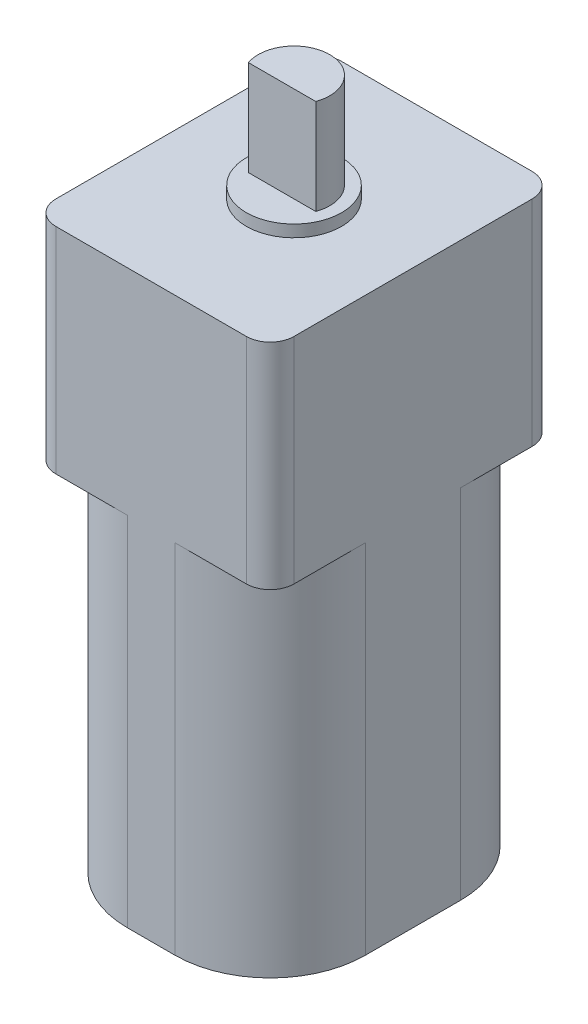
ISO-10303-21;
HEADER;
FILE_DESCRIPTION(('STEP AP214'),'2;1');
FILE_NAME('part.step','',(''),(''),'','','');
FILE_SCHEMA(('AUTOMOTIVE_DESIGN { 1 0 10303 214 1 1 1 1 }'));
ENDSEC;
DATA;
#1=APPLICATION_CONTEXT('core data for automotive mechanical design processes');
#2=APPLICATION_PROTOCOL_DEFINITION('international standard','automotive_design',2000,#1);
#3=PRODUCT_CONTEXT('',#1,'mechanical');
#4=PRODUCT('Part','Part','',(#3));
#5=PRODUCT_RELATED_PRODUCT_CATEGORY('part','',(#4));
#6=PRODUCT_DEFINITION_FORMATION('','',#4);
#7=PRODUCT_DEFINITION_CONTEXT('part definition',#1,'design');
#8=PRODUCT_DEFINITION('design','',#6,#7);
#9=PRODUCT_DEFINITION_SHAPE('','',#8);
#10=(LENGTH_UNIT() NAMED_UNIT(*) SI_UNIT(.MILLI.,.METRE.));
#11=(NAMED_UNIT(*) PLANE_ANGLE_UNIT() SI_UNIT($,.RADIAN.));
#12=(NAMED_UNIT(*) SI_UNIT($,.STERADIAN.) SOLID_ANGLE_UNIT());
#13=UNCERTAINTY_MEASURE_WITH_UNIT(LENGTH_MEASURE(1.E-05),#10,'distance_accuracy_value','');
#14=(GEOMETRIC_REPRESENTATION_CONTEXT(3) GLOBAL_UNCERTAINTY_ASSIGNED_CONTEXT((#13)) GLOBAL_UNIT_ASSIGNED_CONTEXT((#10,
#11,#12)) REPRESENTATION_CONTEXT('',''));
#15=CARTESIAN_POINT('',(0.,0.,0.));
#16=DIRECTION('',(0.,0.,1.));
#17=DIRECTION('',(1.,0.,0.));
#18=AXIS2_PLACEMENT_3D('',#15,#16,#17);
#19=CARTESIAN_POINT('',(0.,17.,6.));
#20=DIRECTION('',(0.,1.,0.));
#21=DIRECTION('',(0.,0.,1.));
#22=AXIS2_PLACEMENT_3D('',#19,#20,#21);
#23=PLANE('',#22);
#24=CARTESIAN_POINT('',(0.,17.,6.));
#25=DIRECTION('',(0.,1.,0.));
#26=DIRECTION('',(0.,0.,1.));
#27=AXIS2_PLACEMENT_3D('',#24,#25,#26);
#28=CIRCLE('',#27,2.);
#29=CARTESIAN_POINT('',(0.,17.,8.));
#30=VERTEX_POINT('',#29);
#31=EDGE_CURVE('E190',#30,#30,#28,.T.);
#32=ORIENTED_EDGE('',*,*,#31,.T.);
#33=EDGE_LOOP('',(#32));
#34=FACE_BOUND('',#33,.T.);
#35=DIRECTION('',(1.,0.,0.));
#36=VECTOR('',#35,1.);
#37=CARTESIAN_POINT('',(1.41421356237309,17.,6.5));
#38=LINE('',#37,#36);
#39=CARTESIAN_POINT('',(-1.41421356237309,17.,6.5));
#40=VERTEX_POINT('',#39);
#41=CARTESIAN_POINT('',(1.41421356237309,17.,6.5));
#42=VERTEX_POINT('',#41);
#43=EDGE_CURVE('E184',#40,#42,#38,.T.);
#44=ORIENTED_EDGE('',*,*,#43,.F.);
#45=CARTESIAN_POINT('',(0.,17.,6.));
#46=DIRECTION('',(0.,1.,0.));
#47=DIRECTION('',(0.,0.,1.));
#48=AXIS2_PLACEMENT_3D('',#45,#46,#47);
#49=CIRCLE('',#48,1.5);
#50=EDGE_CURVE('E61',#42,#40,#49,.T.);
#51=ORIENTED_EDGE('',*,*,#50,.F.);
#52=EDGE_LOOP('',(#44,#51));
#53=FACE_BOUND('',#52,.T.);
#54=ADVANCED_FACE('F40',(#34,#53),#23,.T.);
#55=CARTESIAN_POINT('',(5.,7.5,12.));
#56=DIRECTION('',(-1.,0.,0.));
#57=DIRECTION('',(0.,-1.,0.));
#58=AXIS2_PLACEMENT_3D('',#55,#56,#57);
#59=PLANE('',#58);
#60=DIRECTION('',(0.,0.,-1.));
#61=VECTOR('',#60,1.);
#62=CARTESIAN_POINT('',(5.,16.5,12.));
#63=LINE('',#62,#61);
#64=CARTESIAN_POINT('',(5.,16.5,11.));
#65=VERTEX_POINT('',#64);
#66=CARTESIAN_POINT('',(5.,16.5,1.));
#67=VERTEX_POINT('',#66);
#68=EDGE_CURVE('E205',#65,#67,#63,.T.);
#69=ORIENTED_EDGE('',*,*,#68,.F.);
#70=DIRECTION('',(0.,-1.,0.));
#71=VECTOR('',#70,1.);
#72=CARTESIAN_POINT('',(5.,7.5,11.));
#73=LINE('',#72,#71);
#74=CARTESIAN_POINT('',(5.,7.5,11.));
#75=VERTEX_POINT('',#74);
#76=EDGE_CURVE('E302',#65,#75,#73,.T.);
#77=ORIENTED_EDGE('',*,*,#76,.T.);
#78=DIRECTION('',(0.,0.,-1.));
#79=VECTOR('',#78,1.);
#80=CARTESIAN_POINT('',(5.,7.5,12.));
#81=LINE('',#80,#79);
#82=CARTESIAN_POINT('',(5.,7.5,8.));
#83=VERTEX_POINT('',#82);
#84=EDGE_CURVE('E218',#75,#83,#81,.T.);
#85=ORIENTED_EDGE('',*,*,#84,.T.);
#86=DIRECTION('',(0.,1.,0.));
#87=VECTOR('',#86,1.);
#88=CARTESIAN_POINT('',(5.,-7.5,8.));
#89=LINE('',#88,#87);
#90=CARTESIAN_POINT('',(5.,-7.5,8.));
#91=VERTEX_POINT('',#90);
#92=EDGE_CURVE('E254',#83,#91,#89,.F.);
#93=ORIENTED_EDGE('',*,*,#92,.T.);
#94=DIRECTION('',(0.,0.,-1.));
#95=VECTOR('',#94,1.);
#96=CARTESIAN_POINT('',(5.,-7.5,12.));
#97=LINE('',#96,#95);
#98=CARTESIAN_POINT('',(5.,-7.5,4.));
#99=VERTEX_POINT('',#98);
#100=EDGE_CURVE('E225',#91,#99,#97,.T.);
#101=ORIENTED_EDGE('',*,*,#100,.T.);
#102=DIRECTION('',(0.,1.,0.));
#103=VECTOR('',#102,1.);
#104=CARTESIAN_POINT('',(5.,7.5,4.));
#105=LINE('',#104,#103);
#106=CARTESIAN_POINT('',(5.,7.5,4.));
#107=VERTEX_POINT('',#106);
#108=EDGE_CURVE('E251',#99,#107,#105,.T.);
#109=ORIENTED_EDGE('',*,*,#108,.T.);
#110=CARTESIAN_POINT('',(5.,7.5,1.));
#111=VERTEX_POINT('',#110);
#112=EDGE_CURVE('E217',#107,#111,#81,.T.);
#113=ORIENTED_EDGE('',*,*,#112,.T.);
#114=DIRECTION('',(0.,-1.,0.));
#115=VECTOR('',#114,1.);
#116=CARTESIAN_POINT('',(5.,7.5,1.));
#117=LINE('',#116,#115);
#118=EDGE_CURVE('E300',#111,#67,#117,.F.);
#119=ORIENTED_EDGE('',*,*,#118,.T.);
#120=EDGE_LOOP('',(#69,#77,#85,#93,#101,#109,#113,#119));
#121=FACE_BOUND('',#120,.T.);
#122=ADVANCED_FACE('F380',(#121),#59,.F.);
#123=CARTESIAN_POINT('',(-5.,7.5,12.));
#124=DIRECTION('',(1.,0.,0.));
#125=DIRECTION('',(0.,1.,0.));
#126=AXIS2_PLACEMENT_3D('',#123,#124,#125);
#127=PLANE('',#126);
#128=DIRECTION('',(0.,0.,1.));
#129=VECTOR('',#128,1.);
#130=CARTESIAN_POINT('',(-5.,16.5,12.));
#131=LINE('',#130,#129);
#132=CARTESIAN_POINT('',(-5.,16.5,1.));
#133=VERTEX_POINT('',#132);
#134=CARTESIAN_POINT('',(-5.,16.5,11.));
#135=VERTEX_POINT('',#134);
#136=EDGE_CURVE('E198',#133,#135,#131,.T.);
#137=ORIENTED_EDGE('',*,*,#136,.F.);
#138=DIRECTION('',(0.,-1.,0.));
#139=VECTOR('',#138,1.);
#140=CARTESIAN_POINT('',(-5.,7.5,1.));
#141=LINE('',#140,#139);
#142=CARTESIAN_POINT('',(-5.,7.5,1.));
#143=VERTEX_POINT('',#142);
#144=EDGE_CURVE('E275',#133,#143,#141,.T.);
#145=ORIENTED_EDGE('',*,*,#144,.T.);
#146=DIRECTION('',(0.,0.,1.));
#147=VECTOR('',#146,1.);
#148=CARTESIAN_POINT('',(-5.,7.5,12.));
#149=LINE('',#148,#147);
#150=CARTESIAN_POINT('',(-5.,7.5,4.));
#151=VERTEX_POINT('',#150);
#152=EDGE_CURVE('E212',#143,#151,#149,.T.);
#153=ORIENTED_EDGE('',*,*,#152,.T.);
#154=DIRECTION('',(0.,-1.,0.));
#155=VECTOR('',#154,1.);
#156=CARTESIAN_POINT('',(-5.,7.5,4.));
#157=LINE('',#156,#155);
#158=CARTESIAN_POINT('',(-5.,-7.5,4.));
#159=VERTEX_POINT('',#158);
#160=EDGE_CURVE('E264',#151,#159,#157,.T.);
#161=ORIENTED_EDGE('',*,*,#160,.T.);
#162=DIRECTION('',(0.,0.,-1.));
#163=VECTOR('',#162,1.);
#164=CARTESIAN_POINT('',(-5.,-7.5,12.));
#165=LINE('',#164,#163);
#166=CARTESIAN_POINT('',(-5.,-7.5,8.));
#167=VERTEX_POINT('',#166);
#168=EDGE_CURVE('E230',#167,#159,#165,.T.);
#169=ORIENTED_EDGE('',*,*,#168,.F.);
#170=DIRECTION('',(0.,-1.,0.));
#171=VECTOR('',#170,1.);
#172=CARTESIAN_POINT('',(-5.,7.5,8.));
#173=LINE('',#172,#171);
#174=CARTESIAN_POINT('',(-5.,7.5,8.));
#175=VERTEX_POINT('',#174);
#176=EDGE_CURVE('E267',#167,#175,#173,.F.);
#177=ORIENTED_EDGE('',*,*,#176,.T.);
#178=CARTESIAN_POINT('',(-5.,7.5,11.));
#179=VERTEX_POINT('',#178);
#180=EDGE_CURVE('E196',#175,#179,#149,.T.);
#181=ORIENTED_EDGE('',*,*,#180,.T.);
#182=DIRECTION('',(0.,-1.,0.));
#183=VECTOR('',#182,1.);
#184=CARTESIAN_POINT('',(-5.,16.5,11.));
#185=LINE('',#184,#183);
#186=EDGE_CURVE('E273',#179,#135,#185,.F.);
#187=ORIENTED_EDGE('',*,*,#186,.T.);
#188=EDGE_LOOP('',(#137,#145,#153,#161,#169,#177,#181,#187));
#189=FACE_BOUND('',#188,.T.);
#190=ADVANCED_FACE('F360',(#189),#127,.F.);
#191=CARTESIAN_POINT('',(-5.,-7.5,12.));
#192=DIRECTION('',(0.,1.,0.));
#193=DIRECTION('',(0.,0.,1.));
#194=AXIS2_PLACEMENT_3D('',#191,#192,#193);
#195=PLANE('',#194);
#196=CARTESIAN_POINT('',(0.,-7.5,6.));
#197=DIRECTION('',(0.,1.,0.));
#198=DIRECTION('',(0.,0.,1.));
#199=AXIS2_PLACEMENT_3D('',#196,#197,#198);
#200=CIRCLE('',#199,2.);
#201=CARTESIAN_POINT('',(0.,-7.5,8.));
#202=VERTEX_POINT('',#201);
#203=EDGE_CURVE('E307',#202,#202,#200,.F.);
#204=ORIENTED_EDGE('',*,*,#203,.F.);
#205=EDGE_LOOP('',(#204));
#206=FACE_BOUND('',#205,.T.);
#207=ORIENTED_EDGE('',*,*,#100,.F.);
#208=CARTESIAN_POINT('',(1.,-7.5,8.));
#209=DIRECTION('',(0.,1.,0.));
#210=DIRECTION('',(0.,0.,1.));
#211=AXIS2_PLACEMENT_3D('',#208,#209,#210);
#212=CIRCLE('',#211,4.);
#213=CARTESIAN_POINT('',(1.,-7.5,12.));
#214=VERTEX_POINT('',#213);
#215=EDGE_CURVE('E262',#91,#214,#212,.F.);
#216=ORIENTED_EDGE('',*,*,#215,.T.);
#217=DIRECTION('',(1.,0.,0.));
#218=VECTOR('',#217,1.);
#219=CARTESIAN_POINT('',(-5.,-7.5,12.));
#220=LINE('',#219,#218);
#221=CARTESIAN_POINT('',(-0.999999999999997,-7.5,12.));
#222=VERTEX_POINT('',#221);
#223=EDGE_CURVE('E222',#222,#214,#220,.T.);
#224=ORIENTED_EDGE('',*,*,#223,.F.);
#225=CARTESIAN_POINT('',(-0.999999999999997,-7.5,8.));
#226=DIRECTION('',(0.,1.,0.));
#227=DIRECTION('',(0.,0.,1.));
#228=AXIS2_PLACEMENT_3D('',#225,#226,#227);
#229=CIRCLE('',#228,4.);
#230=EDGE_CURVE('E260',#222,#167,#229,.F.);
#231=ORIENTED_EDGE('',*,*,#230,.T.);
#232=ORIENTED_EDGE('',*,*,#168,.T.);
#233=CARTESIAN_POINT('',(-0.999999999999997,-7.5,4.));
#234=DIRECTION('',(0.,1.,0.));
#235=DIRECTION('',(0.,0.,1.));
#236=AXIS2_PLACEMENT_3D('',#233,#234,#235);
#237=CIRCLE('',#236,4.);
#238=CARTESIAN_POINT('',(-0.999999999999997,-7.5,0.));
#239=VERTEX_POINT('',#238);
#240=EDGE_CURVE('E256',#159,#239,#237,.F.);
#241=ORIENTED_EDGE('',*,*,#240,.T.);
#242=DIRECTION('',(1.,0.,0.));
#243=VECTOR('',#242,1.);
#244=CARTESIAN_POINT('',(-5.,-7.5,0.));
#245=LINE('',#244,#243);
#246=CARTESIAN_POINT('',(1.,-7.5,0.));
#247=VERTEX_POINT('',#246);
#248=EDGE_CURVE('E211',#239,#247,#245,.T.);
#249=ORIENTED_EDGE('',*,*,#248,.T.);
#250=CARTESIAN_POINT('',(1.,-7.5,4.));
#251=DIRECTION('',(0.,1.,0.));
#252=DIRECTION('',(0.,0.,1.));
#253=AXIS2_PLACEMENT_3D('',#250,#251,#252);
#254=CIRCLE('',#253,4.);
#255=EDGE_CURVE('E258',#247,#99,#254,.F.);
#256=ORIENTED_EDGE('',*,*,#255,.T.);
#257=EDGE_LOOP('',(#207,#216,#224,#231,#232,#241,#249,#256));
#258=FACE_BOUND('',#257,.T.);
#259=ADVANCED_FACE('F356',(#206,#258),#195,.F.);
#260=CARTESIAN_POINT('',(0.,0.,12.));
#261=DIRECTION('',(0.,0.,1.));
#262=DIRECTION('',(1.,0.,0.));
#263=AXIS2_PLACEMENT_3D('',#260,#261,#262);
#264=PLANE('',#263);
#265=DIRECTION('',(1.,0.,0.));
#266=VECTOR('',#265,1.);
#267=CARTESIAN_POINT('',(5.,16.5,12.));
#268=LINE('',#267,#266);
#269=CARTESIAN_POINT('',(-4.,16.5,12.));
#270=VERTEX_POINT('',#269);
#271=CARTESIAN_POINT('',(4.,16.5,12.));
#272=VERTEX_POINT('',#271);
#273=EDGE_CURVE('E201',#270,#272,#268,.T.);
#274=ORIENTED_EDGE('',*,*,#273,.F.);
#275=DIRECTION('',(0.,-1.,0.));
#276=VECTOR('',#275,1.);
#277=CARTESIAN_POINT('',(-4.,7.5,12.));
#278=LINE('',#277,#276);
#279=CARTESIAN_POINT('',(-4.,7.5,12.));
#280=VERTEX_POINT('',#279);
#281=EDGE_CURVE('E295',#270,#280,#278,.T.);
#282=ORIENTED_EDGE('',*,*,#281,.T.);
#283=DIRECTION('',(1.,0.,0.));
#284=VECTOR('',#283,1.);
#285=CARTESIAN_POINT('',(5.,7.5,12.));
#286=LINE('',#285,#284);
#287=CARTESIAN_POINT('',(-0.999999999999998,7.5,12.));
#288=VERTEX_POINT('',#287);
#289=EDGE_CURVE('E215',#280,#288,#286,.T.);
#290=ORIENTED_EDGE('',*,*,#289,.T.);
#291=DIRECTION('',(0.,-1.,0.));
#292=VECTOR('',#291,1.);
#293=CARTESIAN_POINT('',(-0.999999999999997,-7.5,12.));
#294=LINE('',#293,#292);
#295=EDGE_CURVE('E233',#288,#222,#294,.T.);
#296=ORIENTED_EDGE('',*,*,#295,.T.);
#297=ORIENTED_EDGE('',*,*,#223,.T.);
#298=DIRECTION('',(0.,1.,0.));
#299=VECTOR('',#298,1.);
#300=CARTESIAN_POINT('',(1.,7.5,12.));
#301=LINE('',#300,#299);
#302=CARTESIAN_POINT('',(1.,7.5,12.));
#303=VERTEX_POINT('',#302);
#304=EDGE_CURVE('E236',#214,#303,#301,.T.);
#305=ORIENTED_EDGE('',*,*,#304,.T.);
#306=CARTESIAN_POINT('',(4.,7.5,12.));
#307=VERTEX_POINT('',#306);
#308=EDGE_CURVE('E214',#303,#307,#286,.T.);
#309=ORIENTED_EDGE('',*,*,#308,.T.);
#310=DIRECTION('',(0.,-1.,0.));
#311=VECTOR('',#310,1.);
#312=CARTESIAN_POINT('',(4.,16.5,12.));
#313=LINE('',#312,#311);
#314=EDGE_CURVE('E293',#307,#272,#313,.F.);
#315=ORIENTED_EDGE('',*,*,#314,.T.);
#316=EDGE_LOOP('',(#274,#282,#290,#296,#297,#305,#309,#315));
#317=FACE_BOUND('',#316,.T.);
#318=ADVANCED_FACE('F359',(#317),#264,.T.);
#319=CARTESIAN_POINT('',(0.,0.,0.));
#320=DIRECTION('',(0.,0.,1.));
#321=DIRECTION('',(1.,0.,0.));
#322=AXIS2_PLACEMENT_3D('',#319,#320,#321);
#323=PLANE('',#322);
#324=DIRECTION('',(-1.,0.,0.));
#325=VECTOR('',#324,1.);
#326=CARTESIAN_POINT('',(5.,7.5,0.));
#327=LINE('',#326,#325);
#328=CARTESIAN_POINT('',(-0.999999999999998,7.5,0.));
#329=VERTEX_POINT('',#328);
#330=CARTESIAN_POINT('',(-4.,7.5,0.));
#331=VERTEX_POINT('',#330);
#332=EDGE_CURVE('E220',#329,#331,#327,.T.);
#333=ORIENTED_EDGE('',*,*,#332,.T.);
#334=DIRECTION('',(0.,-1.,0.));
#335=VECTOR('',#334,1.);
#336=CARTESIAN_POINT('',(-4.,0.,0.));
#337=LINE('',#336,#335);
#338=CARTESIAN_POINT('',(-4.,16.5,0.));
#339=VERTEX_POINT('',#338);
#340=EDGE_CURVE('E283',#331,#339,#337,.F.);
#341=ORIENTED_EDGE('',*,*,#340,.T.);
#342=DIRECTION('',(-1.,0.,0.));
#343=VECTOR('',#342,1.);
#344=CARTESIAN_POINT('',(5.,16.5,0.));
#345=LINE('',#344,#343);
#346=CARTESIAN_POINT('',(4.,16.5,0.));
#347=VERTEX_POINT('',#346);
#348=EDGE_CURVE('E208',#347,#339,#345,.T.);
#349=ORIENTED_EDGE('',*,*,#348,.F.);
#350=DIRECTION('',(0.,-1.,0.));
#351=VECTOR('',#350,1.);
#352=CARTESIAN_POINT('',(4.,0.,0.));
#353=LINE('',#352,#351);
#354=CARTESIAN_POINT('',(4.,7.5,0.));
#355=VERTEX_POINT('',#354);
#356=EDGE_CURVE('E280',#347,#355,#353,.T.);
#357=ORIENTED_EDGE('',*,*,#356,.T.);
#358=CARTESIAN_POINT('',(1.,7.5,0.));
#359=VERTEX_POINT('',#358);
#360=EDGE_CURVE('E202',#355,#359,#327,.T.);
#361=ORIENTED_EDGE('',*,*,#360,.T.);
#362=DIRECTION('',(0.,1.,0.));
#363=VECTOR('',#362,1.);
#364=CARTESIAN_POINT('',(1.,0.,0.));
#365=LINE('',#364,#363);
#366=EDGE_CURVE('E271',#359,#247,#365,.F.);
#367=ORIENTED_EDGE('',*,*,#366,.T.);
#368=ORIENTED_EDGE('',*,*,#248,.F.);
#369=DIRECTION('',(0.,-1.,0.));
#370=VECTOR('',#369,1.);
#371=CARTESIAN_POINT('',(-0.999999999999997,0.,0.));
#372=LINE('',#371,#370);
#373=EDGE_CURVE('E269',#239,#329,#372,.F.);
#374=ORIENTED_EDGE('',*,*,#373,.T.);
#375=EDGE_LOOP('',(#333,#341,#349,#357,#361,#367,#368,#374));
#376=FACE_BOUND('',#375,.T.);
#377=ADVANCED_FACE('F410',(#376),#323,.F.);
#378=CARTESIAN_POINT('',(1.,0.,8.));
#379=DIRECTION('',(0.,-1.,0.));
#380=DIRECTION('',(1.,0.,0.));
#381=AXIS2_PLACEMENT_3D('',#378,#379,#380);
#382=CYLINDRICAL_SURFACE('',#381,4.);
#383=ORIENTED_EDGE('',*,*,#215,.F.);
#384=ORIENTED_EDGE('',*,*,#92,.F.);
#385=CARTESIAN_POINT('',(1.,7.5,8.));
#386=DIRECTION('',(0.,-1.,0.));
#387=DIRECTION('',(0.,0.,-1.));
#388=AXIS2_PLACEMENT_3D('',#385,#386,#387);
#389=CIRCLE('',#388,4.);
#390=EDGE_CURVE('E248',#303,#83,#389,.F.);
#391=ORIENTED_EDGE('',*,*,#390,.F.);
#392=ORIENTED_EDGE('',*,*,#304,.F.);
#393=EDGE_LOOP('',(#383,#384,#391,#392));
#394=FACE_BOUND('',#393,.T.);
#395=ADVANCED_FACE('F371',(#394),#382,.T.);
#396=CARTESIAN_POINT('',(-0.999999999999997,0.,8.));
#397=DIRECTION('',(0.,1.,0.));
#398=DIRECTION('',(-1.,0.,0.));
#399=AXIS2_PLACEMENT_3D('',#396,#397,#398);
#400=CYLINDRICAL_SURFACE('',#399,4.);
#401=CARTESIAN_POINT('',(-0.999999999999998,7.5,8.));
#402=DIRECTION('',(0.,-1.,0.));
#403=DIRECTION('',(0.,0.,-1.));
#404=AXIS2_PLACEMENT_3D('',#401,#402,#403);
#405=CIRCLE('',#404,4.);
#406=EDGE_CURVE('E245',#175,#288,#405,.F.);
#407=ORIENTED_EDGE('',*,*,#406,.F.);
#408=ORIENTED_EDGE('',*,*,#176,.F.);
#409=ORIENTED_EDGE('',*,*,#230,.F.);
#410=ORIENTED_EDGE('',*,*,#295,.F.);
#411=EDGE_LOOP('',(#407,#408,#409,#410));
#412=FACE_BOUND('',#411,.T.);
#413=ADVANCED_FACE('F403',(#412),#400,.T.);
#414=CARTESIAN_POINT('',(1.,7.5,4.));
#415=DIRECTION('',(0.,1.,0.));
#416=DIRECTION('',(-1.,0.,0.));
#417=AXIS2_PLACEMENT_3D('',#414,#415,#416);
#418=CYLINDRICAL_SURFACE('',#417,4.);
#419=ORIENTED_EDGE('',*,*,#255,.F.);
#420=ORIENTED_EDGE('',*,*,#366,.F.);
#421=CARTESIAN_POINT('',(1.,7.5,4.));
#422=DIRECTION('',(0.,-1.,0.));
#423=DIRECTION('',(0.,0.,-1.));
#424=AXIS2_PLACEMENT_3D('',#421,#422,#423);
#425=CIRCLE('',#424,4.);
#426=EDGE_CURVE('E242',#107,#359,#425,.F.);
#427=ORIENTED_EDGE('',*,*,#426,.F.);
#428=ORIENTED_EDGE('',*,*,#108,.F.);
#429=EDGE_LOOP('',(#419,#420,#427,#428));
#430=FACE_BOUND('',#429,.T.);
#431=ADVANCED_FACE('F434',(#430),#418,.T.);
#432=CARTESIAN_POINT('',(-0.999999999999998,7.5,4.));
#433=DIRECTION('',(0.,-1.,0.));
#434=DIRECTION('',(1.,0.,0.));
#435=AXIS2_PLACEMENT_3D('',#432,#433,#434);
#436=CYLINDRICAL_SURFACE('',#435,4.);
#437=CARTESIAN_POINT('',(-0.999999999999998,7.5,4.));
#438=DIRECTION('',(0.,-1.,0.));
#439=DIRECTION('',(0.,0.,-1.));
#440=AXIS2_PLACEMENT_3D('',#437,#438,#439);
#441=CIRCLE('',#440,4.);
#442=EDGE_CURVE('E239',#329,#151,#441,.F.);
#443=ORIENTED_EDGE('',*,*,#442,.F.);
#444=ORIENTED_EDGE('',*,*,#373,.F.);
#445=ORIENTED_EDGE('',*,*,#240,.F.);
#446=ORIENTED_EDGE('',*,*,#160,.F.);
#447=EDGE_LOOP('',(#443,#444,#445,#446));
#448=FACE_BOUND('',#447,.T.);
#449=ADVANCED_FACE('F413',(#448),#436,.T.);
#450=CARTESIAN_POINT('',(0.,7.5,0.));
#451=DIRECTION('',(0.,1.,0.));
#452=DIRECTION('',(0.,0.,1.));
#453=AXIS2_PLACEMENT_3D('',#450,#451,#452);
#454=PLANE('',#453);
#455=ORIENTED_EDGE('',*,*,#84,.F.);
#456=CARTESIAN_POINT('',(4.,7.5,11.));
#457=DIRECTION('',(0.,1.,0.));
#458=DIRECTION('',(0.,0.,1.));
#459=AXIS2_PLACEMENT_3D('',#456,#457,#458);
#460=CIRCLE('',#459,1.);
#461=EDGE_CURVE('E69',#75,#307,#460,.F.);
#462=ORIENTED_EDGE('',*,*,#461,.T.);
#463=ORIENTED_EDGE('',*,*,#308,.F.);
#464=ORIENTED_EDGE('',*,*,#390,.T.);
#465=EDGE_LOOP('',(#455,#462,#463,#464));
#466=FACE_BOUND('',#465,.T.);
#467=ADVANCED_FACE('F378',(#466),#454,.F.);
#468=ORIENTED_EDGE('',*,*,#360,.F.);
#469=CARTESIAN_POINT('',(4.,7.5,1.));
#470=DIRECTION('',(0.,1.,0.));
#471=DIRECTION('',(0.,0.,1.));
#472=AXIS2_PLACEMENT_3D('',#469,#470,#471);
#473=CIRCLE('',#472,1.);
#474=EDGE_CURVE('E305',#355,#111,#473,.F.);
#475=ORIENTED_EDGE('',*,*,#474,.T.);
#476=ORIENTED_EDGE('',*,*,#112,.F.);
#477=ORIENTED_EDGE('',*,*,#426,.T.);
#478=EDGE_LOOP('',(#468,#475,#476,#477));
#479=FACE_BOUND('',#478,.T.);
#480=ADVANCED_FACE('F432',(#479),#454,.F.);
#481=ORIENTED_EDGE('',*,*,#152,.F.);
#482=CARTESIAN_POINT('',(-4.,7.5,1.));
#483=DIRECTION('',(0.,1.,0.));
#484=DIRECTION('',(0.,0.,1.));
#485=AXIS2_PLACEMENT_3D('',#482,#483,#484);
#486=CIRCLE('',#485,1.);
#487=EDGE_CURVE('E278',#143,#331,#486,.F.);
#488=ORIENTED_EDGE('',*,*,#487,.T.);
#489=ORIENTED_EDGE('',*,*,#332,.F.);
#490=ORIENTED_EDGE('',*,*,#442,.T.);
#491=EDGE_LOOP('',(#481,#488,#489,#490));
#492=FACE_BOUND('',#491,.T.);
#493=ADVANCED_FACE('F417',(#492),#454,.F.);
#494=CARTESIAN_POINT('',(0.,16.5,0.));
#495=DIRECTION('',(0.,1.,0.));
#496=DIRECTION('',(0.,0.,1.));
#497=AXIS2_PLACEMENT_3D('',#494,#495,#496);
#498=PLANE('',#497);
#499=CARTESIAN_POINT('',(0.,16.5,6.));
#500=DIRECTION('',(0.,1.,0.));
#501=DIRECTION('',(0.,0.,1.));
#502=AXIS2_PLACEMENT_3D('',#499,#500,#501);
#503=CIRCLE('',#502,2.);
#504=CARTESIAN_POINT('',(0.,16.5,8.));
#505=VERTEX_POINT('',#504);
#506=EDGE_CURVE('E187',#505,#505,#503,.T.);
#507=ORIENTED_EDGE('',*,*,#506,.F.);
#508=EDGE_LOOP('',(#507));
#509=FACE_BOUND('',#508,.T.);
#510=ORIENTED_EDGE('',*,*,#348,.T.);
#511=CARTESIAN_POINT('',(-4.,16.5,1.));
#512=DIRECTION('',(0.,1.,0.));
#513=DIRECTION('',(0.,0.,1.));
#514=AXIS2_PLACEMENT_3D('',#511,#512,#513);
#515=CIRCLE('',#514,1.);
#516=EDGE_CURVE('E291',#339,#133,#515,.T.);
#517=ORIENTED_EDGE('',*,*,#516,.T.);
#518=ORIENTED_EDGE('',*,*,#136,.T.);
#519=CARTESIAN_POINT('',(-4.,16.5,11.));
#520=DIRECTION('',(0.,1.,0.));
#521=DIRECTION('',(0.,0.,1.));
#522=AXIS2_PLACEMENT_3D('',#519,#520,#521);
#523=CIRCLE('',#522,1.);
#524=EDGE_CURVE('E289',#135,#270,#523,.T.);
#525=ORIENTED_EDGE('',*,*,#524,.T.);
#526=ORIENTED_EDGE('',*,*,#273,.T.);
#527=CARTESIAN_POINT('',(4.,16.5,11.));
#528=DIRECTION('',(0.,1.,0.));
#529=DIRECTION('',(0.,0.,1.));
#530=AXIS2_PLACEMENT_3D('',#527,#528,#529);
#531=CIRCLE('',#530,1.);
#532=EDGE_CURVE('E287',#272,#65,#531,.T.);
#533=ORIENTED_EDGE('',*,*,#532,.T.);
#534=ORIENTED_EDGE('',*,*,#68,.T.);
#535=CARTESIAN_POINT('',(4.,16.5,1.));
#536=DIRECTION('',(0.,1.,0.));
#537=DIRECTION('',(0.,0.,1.));
#538=AXIS2_PLACEMENT_3D('',#535,#536,#537);
#539=CIRCLE('',#538,1.);
#540=EDGE_CURVE('E285',#67,#347,#539,.T.);
#541=ORIENTED_EDGE('',*,*,#540,.T.);
#542=EDGE_LOOP('',(#510,#517,#518,#525,#526,#533,#534,#541));
#543=FACE_BOUND('',#542,.T.);
#544=ADVANCED_FACE('F384',(#509,#543),#498,.T.);
#545=ORIENTED_EDGE('',*,*,#289,.F.);
#546=CARTESIAN_POINT('',(-4.,7.5,11.));
#547=DIRECTION('',(0.,1.,0.));
#548=DIRECTION('',(0.,0.,1.));
#549=AXIS2_PLACEMENT_3D('',#546,#547,#548);
#550=CIRCLE('',#549,1.);
#551=EDGE_CURVE('E298',#280,#179,#550,.F.);
#552=ORIENTED_EDGE('',*,*,#551,.T.);
#553=ORIENTED_EDGE('',*,*,#180,.F.);
#554=ORIENTED_EDGE('',*,*,#406,.T.);
#555=EDGE_LOOP('',(#545,#552,#553,#554));
#556=FACE_BOUND('',#555,.T.);
#557=ADVANCED_FACE('F395',(#556),#454,.F.);
#558=CARTESIAN_POINT('',(-4.,7.5,1.));
#559=DIRECTION('',(0.,-1.,0.));
#560=DIRECTION('',(1.,0.,0.));
#561=AXIS2_PLACEMENT_3D('',#558,#559,#560);
#562=CYLINDRICAL_SURFACE('',#561,1.);
#563=ORIENTED_EDGE('',*,*,#516,.F.);
#564=ORIENTED_EDGE('',*,*,#340,.F.);
#565=ORIENTED_EDGE('',*,*,#487,.F.);
#566=ORIENTED_EDGE('',*,*,#144,.F.);
#567=EDGE_LOOP('',(#563,#564,#565,#566));
#568=FACE_BOUND('',#567,.T.);
#569=ADVANCED_FACE('F422',(#568),#562,.T.);
#570=CARTESIAN_POINT('',(-4.,0.,11.));
#571=DIRECTION('',(0.,1.,0.));
#572=DIRECTION('',(-1.,0.,0.));
#573=AXIS2_PLACEMENT_3D('',#570,#571,#572);
#574=CYLINDRICAL_SURFACE('',#573,1.);
#575=ORIENTED_EDGE('',*,*,#524,.F.);
#576=ORIENTED_EDGE('',*,*,#186,.F.);
#577=ORIENTED_EDGE('',*,*,#551,.F.);
#578=ORIENTED_EDGE('',*,*,#281,.F.);
#579=EDGE_LOOP('',(#575,#576,#577,#578));
#580=FACE_BOUND('',#579,.T.);
#581=ADVANCED_FACE('F390',(#580),#574,.T.);
#582=CARTESIAN_POINT('',(4.,7.5,11.));
#583=DIRECTION('',(0.,1.,0.));
#584=DIRECTION('',(-1.,0.,0.));
#585=AXIS2_PLACEMENT_3D('',#582,#583,#584);
#586=CYLINDRICAL_SURFACE('',#585,1.);
#587=ORIENTED_EDGE('',*,*,#532,.F.);
#588=ORIENTED_EDGE('',*,*,#314,.F.);
#589=ORIENTED_EDGE('',*,*,#461,.F.);
#590=ORIENTED_EDGE('',*,*,#76,.F.);
#591=EDGE_LOOP('',(#587,#588,#589,#590));
#592=FACE_BOUND('',#591,.T.);
#593=ADVANCED_FACE('F382',(#592),#586,.T.);
#594=CARTESIAN_POINT('',(4.,0.,1.));
#595=DIRECTION('',(0.,-1.,0.));
#596=DIRECTION('',(1.,0.,0.));
#597=AXIS2_PLACEMENT_3D('',#594,#595,#596);
#598=CYLINDRICAL_SURFACE('',#597,1.);
#599=ORIENTED_EDGE('',*,*,#540,.F.);
#600=ORIENTED_EDGE('',*,*,#118,.F.);
#601=ORIENTED_EDGE('',*,*,#474,.F.);
#602=ORIENTED_EDGE('',*,*,#356,.F.);
#603=EDGE_LOOP('',(#599,#600,#601,#602));
#604=FACE_BOUND('',#603,.T.);
#605=ADVANCED_FACE('F427',(#604),#598,.T.);
#606=CARTESIAN_POINT('',(0.,17.,6.));
#607=DIRECTION('',(0.,-1.,0.));
#608=DIRECTION('',(0.,0.,-1.));
#609=AXIS2_PLACEMENT_3D('',#606,#607,#608);
#610=CYLINDRICAL_SURFACE('',#609,2.);
#611=ORIENTED_EDGE('',*,*,#31,.F.);
#612=EDGE_LOOP('',(#611));
#613=FACE_BOUND('',#612,.T.);
#614=ORIENTED_EDGE('',*,*,#506,.T.);
#615=EDGE_LOOP('',(#614));
#616=FACE_BOUND('',#615,.T.);
#617=ADVANCED_FACE('F453',(#613,#616),#610,.T.);
#618=CARTESIAN_POINT('',(0.,21.,6.));
#619=DIRECTION('',(0.,-1.,0.));
#620=DIRECTION('',(0.,0.,-1.));
#621=AXIS2_PLACEMENT_3D('',#618,#619,#620);
#622=CYLINDRICAL_SURFACE('',#621,1.5);
#623=ORIENTED_EDGE('',*,*,#50,.T.);
#624=DIRECTION('',(0.,-1.,0.));
#625=VECTOR('',#624,1.);
#626=CARTESIAN_POINT('',(-1.41421356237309,21.,6.5));
#627=LINE('',#626,#625);
#628=CARTESIAN_POINT('',(-1.41421356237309,21.,6.5));
#629=VERTEX_POINT('',#628);
#630=EDGE_CURVE('E176',#629,#40,#627,.T.);
#631=ORIENTED_EDGE('',*,*,#630,.F.);
#632=CARTESIAN_POINT('',(0.,21.,6.));
#633=DIRECTION('',(0.,1.,0.));
#634=DIRECTION('',(0.,0.,1.));
#635=AXIS2_PLACEMENT_3D('',#632,#633,#634);
#636=CIRCLE('',#635,1.5);
#637=CARTESIAN_POINT('',(1.41421356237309,21.,6.5));
#638=VERTEX_POINT('',#637);
#639=EDGE_CURVE('E181',#638,#629,#636,.T.);
#640=ORIENTED_EDGE('',*,*,#639,.F.);
#641=DIRECTION('',(0.,-1.,0.));
#642=VECTOR('',#641,1.);
#643=CARTESIAN_POINT('',(1.41421356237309,21.,6.5));
#644=LINE('',#643,#642);
#645=EDGE_CURVE('E178',#638,#42,#644,.T.);
#646=ORIENTED_EDGE('',*,*,#645,.T.);
#647=EDGE_LOOP('',(#623,#631,#640,#646));
#648=FACE_BOUND('',#647,.T.);
#649=ADVANCED_FACE('F186',(#648),#622,.T.);
#650=CARTESIAN_POINT('',(1.41421356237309,21.,6.5));
#651=DIRECTION('',(0.,0.,-1.));
#652=DIRECTION('',(-1.,0.,0.));
#653=AXIS2_PLACEMENT_3D('',#650,#651,#652);
#654=PLANE('',#653);
#655=ORIENTED_EDGE('',*,*,#43,.T.);
#656=ORIENTED_EDGE('',*,*,#645,.F.);
#657=DIRECTION('',(1.,0.,0.));
#658=VECTOR('',#657,1.);
#659=CARTESIAN_POINT('',(1.41421356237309,21.,6.5));
#660=LINE('',#659,#658);
#661=EDGE_CURVE('E173',#629,#638,#660,.T.);
#662=ORIENTED_EDGE('',*,*,#661,.F.);
#663=ORIENTED_EDGE('',*,*,#630,.T.);
#664=EDGE_LOOP('',(#655,#656,#662,#663));
#665=FACE_BOUND('',#664,.T.);
#666=ADVANCED_FACE('F175',(#665),#654,.F.);
#667=CARTESIAN_POINT('',(0.,21.,6.));
#668=DIRECTION('',(0.,1.,0.));
#669=DIRECTION('',(0.,0.,1.));
#670=AXIS2_PLACEMENT_3D('',#667,#668,#669);
#671=PLANE('',#670);
#672=ORIENTED_EDGE('',*,*,#639,.T.);
#673=ORIENTED_EDGE('',*,*,#661,.T.);
#674=EDGE_LOOP('',(#672,#673));
#675=FACE_BOUND('',#674,.T.);
#676=ADVANCED_FACE('F183',(#675),#671,.T.);
#677=CARTESIAN_POINT('',(0.,-8.5,6.));
#678=DIRECTION('',(0.,1.,0.));
#679=DIRECTION('',(0.,0.,1.));
#680=AXIS2_PLACEMENT_3D('',#677,#678,#679);
#681=CYLINDRICAL_SURFACE('',#680,2.);
#682=CARTESIAN_POINT('',(0.,-8.,4.));
#683=CARTESIAN_POINT('',(0.26179936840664,-8.,4.));
#684=CARTESIAN_POINT('',(0.523495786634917,-8.,4.05205465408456));
#685=CARTESIAN_POINT('',(1.00723794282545,-8.,4.25242721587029));
#686=CARTESIAN_POINT('',(1.22909345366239,-8.,4.40066632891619));
#687=CARTESIAN_POINT('',(1.59933367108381,-8.,4.77090654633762));
#688=CARTESIAN_POINT('',(1.7475727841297,-8.,4.99276205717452));
#689=CARTESIAN_POINT('',(1.94794534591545,-8.,5.47650421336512));
#690=CARTESIAN_POINT('',(2.,-8.,5.73820063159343));
#691=CARTESIAN_POINT('',(2.,-8.,6.26179936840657));
#692=CARTESIAN_POINT('',(1.94794534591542,-8.,6.52349578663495));
#693=CARTESIAN_POINT('',(1.74757278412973,-8.,7.00723794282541));
#694=CARTESIAN_POINT('',(1.59933367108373,-8.,7.22909345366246));
#695=CARTESIAN_POINT('',(1.22909345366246,-8.,7.59933367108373));
#696=CARTESIAN_POINT('',(1.00723794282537,-8.,7.74757278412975));
#697=CARTESIAN_POINT('',(0.523495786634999,-8.,7.9479453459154));
#698=CARTESIAN_POINT('',(0.261799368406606,-8.,8.));
#699=CARTESIAN_POINT('',(-0.261799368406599,-8.,8.));
#700=CARTESIAN_POINT('',(-0.523495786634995,-8.,7.9479453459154));
#701=CARTESIAN_POINT('',(-1.00723794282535,-8.,7.74757278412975));
#702=CARTESIAN_POINT('',(-1.22909345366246,-8.,7.59933367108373));
#703=CARTESIAN_POINT('',(-1.59933367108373,-8.,7.22909345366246));
#704=CARTESIAN_POINT('',(-1.7475727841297,-8.,7.00723794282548));
#705=CARTESIAN_POINT('',(-1.94794534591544,-8.,6.52349578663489));
#706=CARTESIAN_POINT('',(-2.,-8.,6.26179936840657));
#707=CARTESIAN_POINT('',(-2.,-8.,5.73820063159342));
#708=CARTESIAN_POINT('',(-1.94794534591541,-8.,5.47650421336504));
#709=CARTESIAN_POINT('',(-1.74757278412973,-8.,4.99276205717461));
#710=CARTESIAN_POINT('',(-1.59933367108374,-8.,4.77090654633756));
#711=CARTESIAN_POINT('',(-1.22909345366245,-8.,4.40066632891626));
#712=CARTESIAN_POINT('',(-1.00723794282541,-8.,4.25242721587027));
#713=CARTESIAN_POINT('',(-0.523495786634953,-8.,4.05205465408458));
#714=CARTESIAN_POINT('',(-0.261799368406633,-8.,4.));
#715=CARTESIAN_POINT('',(0.,-8.,4.));
#716=(BOUNDED_CURVE() B_SPLINE_CURVE(3,(#682,#683,#684,#685,#686,#687,#688,#689,#690,#691,#692,
#693,#694,#695,#696,#697,#698,#699,#700,#701,#702,#703,#704,#705,#706,#707,#708,#709,#710,#711,
#712,#713,#714,#715),.UNSPECIFIED.,.T.,.F.) B_SPLINE_CURVE_WITH_KNOTS((4,2,2,2,2,2,2,2,2,2,2,2,
2,2,2,2,4),(0.,0.392699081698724,0.785398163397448,1.17809724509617,1.5707963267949,
1.96349540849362,2.35619449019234,2.74889357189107,3.14159265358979,3.53429173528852,
3.92699081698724,4.31968989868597,4.71238898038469,5.10508806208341,5.49778714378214,
5.89048622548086,6.28318530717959),
.UNSPECIFIED.) CURVE() GEOMETRIC_REPRESENTATION_ITEM() RATIONAL_B_SPLINE_CURVE((1.,1.,1.,1.,1.,
1.,1.,1.,1.,1.,1.,1.,1.,1.,1.,1.,1.,1.,1.,1.,1.,1.,1.,1.,1.,1.,1.,1.,1.,1.,1.,1.,1.,1.)) REPRESENTATION_ITEM(''));
#717=CARTESIAN_POINT('',(0.,-8.,4.));
#718=VERTEX_POINT('',#717);
#719=EDGE_CURVE('E12',#718,#718,#716,.F.);
#720=ORIENTED_EDGE('',*,*,#719,.T.);
#721=EDGE_LOOP('',(#720));
#722=FACE_BOUND('',#721,.T.);
#723=ORIENTED_EDGE('',*,*,#203,.T.);
#724=EDGE_LOOP('',(#723));
#725=FACE_BOUND('',#724,.T.);
#726=ADVANCED_FACE('F328',(#722,#725),#681,.T.);
#727=CARTESIAN_POINT('',(0.,-8.5,6.));
#728=DIRECTION('',(0.,-1.,0.));
#729=DIRECTION('',(0.,0.,-1.));
#730=AXIS2_PLACEMENT_3D('',#727,#728,#729);
#731=PLANE('',#730);
#732=CARTESIAN_POINT('',(0.,-8.5,4.5));
#733=CARTESIAN_POINT('',(-0.024543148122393,-8.5,4.49999996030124));
#734=CARTESIAN_POINT('',(-0.049085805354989,-8.5,4.50060998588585));
#735=CARTESIAN_POINT('',(-0.0981109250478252,-8.5,4.50303859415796));
#736=CARTESIAN_POINT('',(-0.122593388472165,-8.5,4.50485715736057));
#737=CARTESIAN_POINT('',(-0.171440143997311,-8.5,4.50969131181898));
#738=CARTESIAN_POINT('',(-0.195804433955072,-8.5,4.51270692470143));
#739=CARTESIAN_POINT('',(-0.244357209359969,-8.5,4.51992365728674));
#740=CARTESIAN_POINT('',(-0.268545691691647,-8.5,4.52412479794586));
#741=CARTESIAN_POINT('',(-0.316689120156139,-8.5,4.533701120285));
#742=CARTESIAN_POINT('',(-0.340644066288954,-8.5,4.53907630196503));
#743=CARTESIAN_POINT('',(-0.38826271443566,-8.5,4.55098925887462));
#744=CARTESIAN_POINT('',(-0.41192642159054,-8.5,4.55752701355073));
#745=CARTESIAN_POINT('',(-0.458904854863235,-8.5,4.57175366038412));
#746=CARTESIAN_POINT('',(-0.482219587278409,-8.5,4.57944253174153));
#747=CARTESIAN_POINT('',(-0.528442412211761,-8.5,4.59595996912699));
#748=CARTESIAN_POINT('',(-0.551350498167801,-8.5,4.60478855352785));
#749=CARTESIAN_POINT('',(-0.596699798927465,-8.5,4.62357284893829));
#750=CARTESIAN_POINT('',(-0.619141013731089,-8.5,4.63352855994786));
#751=CARTESIAN_POINT('',(-0.663505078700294,-8.5,4.65453344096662));
#752=CARTESIAN_POINT('',(-0.685427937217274,-8.5,4.66558259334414));
#753=CARTESIAN_POINT('',(-0.72870646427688,-8.5,4.68874160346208));
#754=CARTESIAN_POINT('',(-0.75006212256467,-8.5,4.70085148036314));
#755=CARTESIAN_POINT('',(-0.792157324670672,-8.5,4.72609921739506));
#756=CARTESIAN_POINT('',(-0.812896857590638,-8.5,4.73923709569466));
#757=CARTESIAN_POINT('',(-0.853710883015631,-8.5,4.76650815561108));
#758=CARTESIAN_POINT('',(-0.873785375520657,-8.5,4.7806413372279));
#759=CARTESIAN_POINT('',(-0.913220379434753,-8.5,4.80987034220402));
#760=CARTESIAN_POINT('',(-0.932580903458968,-8.5,4.82496614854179));
#761=CARTESIAN_POINT('',(-0.970539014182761,-8.5,4.85608772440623));
#762=CARTESIAN_POINT('',(-0.989136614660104,-8.5,4.87211347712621));
#763=CARTESIAN_POINT('',(-1.02551998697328,-8.5,4.90506230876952));
#764=CARTESIAN_POINT('',(-1.04330574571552,-8.5,4.92198540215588));
#765=CARTESIAN_POINT('',(-1.07801459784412,-8.5,4.95669425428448));
#766=CARTESIAN_POINT('',(-1.09493769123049,-8.5,4.97448001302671));
#767=CARTESIAN_POINT('',(-1.12788652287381,-8.5,5.01086338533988));
#768=CARTESIAN_POINT('',(-1.14391227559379,-8.5,5.02946098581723));
#769=CARTESIAN_POINT('',(-1.17503385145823,-8.5,5.06741909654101));
#770=CARTESIAN_POINT('',(-1.190129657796,-8.5,5.08677962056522));
#771=CARTESIAN_POINT('',(-1.21935866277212,-8.5,5.12621462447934));
#772=CARTESIAN_POINT('',(-1.23349184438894,-8.5,5.14628911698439));
#773=CARTESIAN_POINT('',(-1.26076290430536,-8.5,5.18710314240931));
#774=CARTESIAN_POINT('',(-1.27390078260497,-8.5,5.20784267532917));
#775=CARTESIAN_POINT('',(-1.29914851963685,-8.5,5.24993787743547));
#776=CARTESIAN_POINT('',(-1.31125839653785,-8.5,5.27129353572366));
#777=CARTESIAN_POINT('',(-1.33441740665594,-8.5,5.31457206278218));
#778=CARTESIAN_POINT('',(-1.34546655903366,-8.5,5.33649492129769));
#779=CARTESIAN_POINT('',(-1.36647144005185,-8.5,5.38085898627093));
#780=CARTESIAN_POINT('',(-1.37642715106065,-8.5,5.40330020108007));
#781=CARTESIAN_POINT('',(-1.3952114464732,-8.5,5.44864950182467));
#782=CARTESIAN_POINT('',(-1.40404003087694,-8.5,5.47155758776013));
#783=CARTESIAN_POINT('',(-1.42055746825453,-8.5,5.5177804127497));
#784=CARTESIAN_POINT('',(-1.42824633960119,-8.5,5.54109514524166));
#785=CARTESIAN_POINT('',(-1.44247298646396,-8.5,5.58807357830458));
#786=CARTESIAN_POINT('',(-1.44901074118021,-8.5,5.61173728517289));
#787=CARTESIAN_POINT('',(-1.46092369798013,-8.5,5.65935593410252));
#788=CARTESIAN_POINT('',(-1.46629887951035,-8.5,5.68331088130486));
#789=CARTESIAN_POINT('',(-1.47587520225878,-8.5,5.73145430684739));
#790=CARTESIAN_POINT('',(-1.480076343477,-8.5,5.75564278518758));
#791=CARTESIAN_POINT('',(-1.48729307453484,-8.5,5.80419557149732));
#792=CARTESIAN_POINT('',(-1.49030868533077,-8.5,5.82855987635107));
#793=CARTESIAN_POINT('',(-1.49514284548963,-8.5,5.87740659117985));
#794=CARTESIAN_POINT('',(-1.49696141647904,-8.5,5.90188899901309));
#795=CARTESIAN_POINT('',(-1.49939000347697,-8.5,5.95091427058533));
#796=CARTESIAN_POINT('',(-1.5,-8.5,5.97545713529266));
#797=CARTESIAN_POINT('',(-1.5,-8.5,6.02454286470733));
#798=CARTESIAN_POINT('',(-1.49939000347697,-8.5,6.04908572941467));
#799=CARTESIAN_POINT('',(-1.49696141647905,-8.5,6.0981110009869));
#800=CARTESIAN_POINT('',(-1.49514284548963,-8.5,6.12259340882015));
#801=CARTESIAN_POINT('',(-1.49030868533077,-8.5,6.17144012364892));
#802=CARTESIAN_POINT('',(-1.48729307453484,-8.5,6.19580442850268));
#803=CARTESIAN_POINT('',(-1.480076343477,-8.5,6.24435721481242));
#804=CARTESIAN_POINT('',(-1.47587520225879,-8.5,6.26854569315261));
#805=CARTESIAN_POINT('',(-1.46629887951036,-8.5,6.31668911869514));
#806=CARTESIAN_POINT('',(-1.46092369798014,-8.5,6.34064406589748));
#807=CARTESIAN_POINT('',(-1.44901074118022,-8.5,6.38826271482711));
#808=CARTESIAN_POINT('',(-1.44247298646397,-8.5,6.41192642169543));
#809=CARTESIAN_POINT('',(-1.42824633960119,-8.5,6.45890485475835));
#810=CARTESIAN_POINT('',(-1.42055746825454,-8.5,6.48221958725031));
#811=CARTESIAN_POINT('',(-1.40404003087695,-8.5,6.52844241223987));
#812=CARTESIAN_POINT('',(-1.3952114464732,-8.5,6.55135049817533));
#813=CARTESIAN_POINT('',(-1.37642715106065,-8.5,6.59669979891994));
#814=CARTESIAN_POINT('',(-1.36647144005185,-8.5,6.61914101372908));
#815=CARTESIAN_POINT('',(-1.34546655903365,-8.5,6.66350507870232));
#816=CARTESIAN_POINT('',(-1.33441740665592,-8.5,6.68542793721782));
#817=CARTESIAN_POINT('',(-1.31125839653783,-8.5,6.72870646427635));
#818=CARTESIAN_POINT('',(-1.29914851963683,-8.5,6.75006212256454));
#819=CARTESIAN_POINT('',(-1.27390078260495,-8.5,6.79215732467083));
#820=CARTESIAN_POINT('',(-1.26076290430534,-8.5,6.81289685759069));
#821=CARTESIAN_POINT('',(-1.23349184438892,-8.5,6.85371088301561));
#822=CARTESIAN_POINT('',(-1.2193586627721,-8.5,6.87378537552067));
#823=CARTESIAN_POINT('',(-1.19012965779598,-8.5,6.91322037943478));
#824=CARTESIAN_POINT('',(-1.17503385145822,-8.5,6.93258090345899));
#825=CARTESIAN_POINT('',(-1.14391227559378,-8.5,6.97053901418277));
#826=CARTESIAN_POINT('',(-1.1278865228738,-8.5,6.98913661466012));
#827=CARTESIAN_POINT('',(-1.09493769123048,-8.5,7.02551998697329));
#828=CARTESIAN_POINT('',(-1.07801459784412,-8.5,7.04330574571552));
#829=CARTESIAN_POINT('',(-1.04330574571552,-8.5,7.07801459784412));
#830=CARTESIAN_POINT('',(-1.02551998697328,-8.5,7.09493769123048));
#831=CARTESIAN_POINT('',(-0.989136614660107,-8.5,7.1278865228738));
#832=CARTESIAN_POINT('',(-0.970539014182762,-8.5,7.14391227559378));
#833=CARTESIAN_POINT('',(-0.932580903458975,-8.5,7.17503385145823));
#834=CARTESIAN_POINT('',(-0.913220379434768,-8.5,7.190129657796));
#835=CARTESIAN_POINT('',(-0.87378537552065,-8.5,7.21935866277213));
#836=CARTESIAN_POINT('',(-0.853710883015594,-8.5,7.23349184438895));
#837=CARTESIAN_POINT('',(-0.812896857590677,-8.5,7.26076290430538));
#838=CARTESIAN_POINT('',(-0.792157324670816,-8.5,7.273900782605));
#839=CARTESIAN_POINT('',(-0.750062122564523,-8.5,7.29914851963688));
#840=CARTESIAN_POINT('',(-0.728706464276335,-8.5,7.31125839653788));
#841=CARTESIAN_POINT('',(-0.68542793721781,-8.5,7.33441740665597));
#842=CARTESIAN_POINT('',(-0.663505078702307,-8.5,7.34546655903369));
#843=CARTESIAN_POINT('',(-0.619141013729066,-8.5,7.36647144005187));
#844=CARTESIAN_POINT('',(-0.596699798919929,-8.5,7.37642715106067));
#845=CARTESIAN_POINT('',(-0.551350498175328,-8.5,7.39521144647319));
#846=CARTESIAN_POINT('',(-0.528442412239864,-8.5,7.40404003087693));
#847=CARTESIAN_POINT('',(-0.482219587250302,-8.5,7.42055746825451));
#848=CARTESIAN_POINT('',(-0.458904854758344,-8.5,7.42824633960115));
#849=CARTESIAN_POINT('',(-0.411926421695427,-8.5,7.44247298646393));
#850=CARTESIAN_POINT('',(-0.388262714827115,-8.5,7.44901074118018));
#851=CARTESIAN_POINT('',(-0.340644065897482,-8.5,7.4609236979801));
#852=CARTESIAN_POINT('',(-0.316689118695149,-8.5,7.46629887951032));
#853=CARTESIAN_POINT('',(-0.268545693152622,-8.5,7.47587520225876));
#854=CARTESIAN_POINT('',(-0.244357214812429,-8.5,7.48007634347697));
#855=CARTESIAN_POINT('',(-0.195804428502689,-8.5,7.48729307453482));
#856=CARTESIAN_POINT('',(-0.171440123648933,-8.5,7.49030868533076));
#857=CARTESIAN_POINT('',(-0.122593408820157,-8.5,7.49514284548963));
#858=CARTESIAN_POINT('',(-0.0981110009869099,-8.5,7.49696141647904));
#859=CARTESIAN_POINT('',(-0.0490857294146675,-8.5,7.49939000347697));
#860=CARTESIAN_POINT('',(-0.0245428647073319,-8.5,7.5));
#861=CARTESIAN_POINT('',(0.0245428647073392,-8.5,7.5));
#862=CARTESIAN_POINT('',(0.0490857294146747,-8.5,7.49939000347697));
#863=CARTESIAN_POINT('',(0.0981110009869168,-8.5,7.49696141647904));
#864=CARTESIAN_POINT('',(0.122593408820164,-8.5,7.49514284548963));
#865=CARTESIAN_POINT('',(0.171440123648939,-8.5,7.49030868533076));
#866=CARTESIAN_POINT('',(0.195804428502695,-8.5,7.48729307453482));
#867=CARTESIAN_POINT('',(0.244357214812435,-8.5,7.48007634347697));
#868=CARTESIAN_POINT('',(0.268545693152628,-8.5,7.47587520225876));
#869=CARTESIAN_POINT('',(0.316689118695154,-8.5,7.46629887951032));
#870=CARTESIAN_POINT('',(0.340644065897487,-8.5,7.4609236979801));
#871=CARTESIAN_POINT('',(0.38826271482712,-8.5,7.44901074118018));
#872=CARTESIAN_POINT('',(0.411926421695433,-8.5,7.44247298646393));
#873=CARTESIAN_POINT('',(0.458904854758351,-8.5,7.42824633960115));
#874=CARTESIAN_POINT('',(0.482219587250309,-8.5,7.42055746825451));
#875=CARTESIAN_POINT('',(0.528442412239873,-8.5,7.40404003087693));
#876=CARTESIAN_POINT('',(0.551350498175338,-8.5,7.39521144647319));
#877=CARTESIAN_POINT('',(0.596699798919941,-8.5,7.37642715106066));
#878=CARTESIAN_POINT('',(0.619141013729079,-8.5,7.36647144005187));
#879=CARTESIAN_POINT('',(0.663505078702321,-8.5,7.34546655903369));
#880=CARTESIAN_POINT('',(0.685427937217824,-8.5,7.33441740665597));
#881=CARTESIAN_POINT('',(0.72870646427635,-8.5,7.31125839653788));
#882=CARTESIAN_POINT('',(0.750062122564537,-8.5,7.29914851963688));
#883=CARTESIAN_POINT('',(0.79215732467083,-8.5,7.273900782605));
#884=CARTESIAN_POINT('',(0.81289685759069,-8.5,7.26076290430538));
#885=CARTESIAN_POINT('',(0.853710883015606,-8.5,7.23349184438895));
#886=CARTESIAN_POINT('',(0.873785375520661,-8.5,7.21935866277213));
#887=CARTESIAN_POINT('',(0.913220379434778,-8.5,7.190129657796));
#888=CARTESIAN_POINT('',(0.932580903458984,-8.5,7.17503385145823));
#889=CARTESIAN_POINT('',(0.97053901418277,-8.5,7.14391227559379));
#890=CARTESIAN_POINT('',(0.989136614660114,-8.5,7.1278865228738));
#891=CARTESIAN_POINT('',(1.02551998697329,-8.5,7.09493769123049));
#892=CARTESIAN_POINT('',(1.04330574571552,-8.5,7.07801459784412));
#893=CARTESIAN_POINT('',(1.07801459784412,-8.5,7.04330574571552));
#894=CARTESIAN_POINT('',(1.09493769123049,-8.5,7.02551998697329));
#895=CARTESIAN_POINT('',(1.1278865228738,-8.5,6.98913661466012));
#896=CARTESIAN_POINT('',(1.14391227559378,-8.5,6.97053901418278));
#897=CARTESIAN_POINT('',(1.17503385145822,-8.5,6.93258090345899));
#898=CARTESIAN_POINT('',(1.19012965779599,-8.5,6.91322037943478));
#899=CARTESIAN_POINT('',(1.2193586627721,-8.5,6.87378537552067));
#900=CARTESIAN_POINT('',(1.23349184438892,-8.5,6.85371088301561));
#901=CARTESIAN_POINT('',(1.26076290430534,-8.5,6.81289685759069));
#902=CARTESIAN_POINT('',(1.27390078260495,-8.5,6.79215732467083));
#903=CARTESIAN_POINT('',(1.29914851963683,-8.5,6.75006212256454));
#904=CARTESIAN_POINT('',(1.31125839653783,-8.5,6.72870646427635));
#905=CARTESIAN_POINT('',(1.33441740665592,-8.5,6.68542793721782));
#906=CARTESIAN_POINT('',(1.34546655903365,-8.5,6.66350507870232));
#907=CARTESIAN_POINT('',(1.36647144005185,-8.5,6.61914101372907));
#908=CARTESIAN_POINT('',(1.37642715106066,-8.5,6.59669979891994));
#909=CARTESIAN_POINT('',(1.39521144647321,-8.5,6.55135049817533));
#910=CARTESIAN_POINT('',(1.40404003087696,-8.5,6.52844241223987));
#911=CARTESIAN_POINT('',(1.42055746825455,-8.5,6.4822195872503));
#912=CARTESIAN_POINT('',(1.42824633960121,-8.5,6.45890485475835));
#913=CARTESIAN_POINT('',(1.44247298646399,-8.5,6.41192642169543));
#914=CARTESIAN_POINT('',(1.44901074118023,-8.5,6.38826271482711));
#915=CARTESIAN_POINT('',(1.46092369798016,-8.5,6.34064406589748));
#916=CARTESIAN_POINT('',(1.46629887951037,-8.5,6.31668911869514));
#917=CARTESIAN_POINT('',(1.4758752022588,-8.5,6.26854569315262));
#918=CARTESIAN_POINT('',(1.48007634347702,-8.5,6.24435721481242));
#919=CARTESIAN_POINT('',(1.48729307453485,-8.5,6.19580442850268));
#920=CARTESIAN_POINT('',(1.49030868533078,-8.5,6.17144012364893));
#921=CARTESIAN_POINT('',(1.49514284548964,-8.5,6.12259340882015));
#922=CARTESIAN_POINT('',(1.49696141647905,-8.5,6.09811100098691));
#923=CARTESIAN_POINT('',(1.49939000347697,-8.5,6.04908572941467));
#924=CARTESIAN_POINT('',(1.5,-8.5,6.02454286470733));
#925=CARTESIAN_POINT('',(1.5,-8.5,5.97545713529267));
#926=CARTESIAN_POINT('',(1.49939000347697,-8.5,5.95091427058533));
#927=CARTESIAN_POINT('',(1.49696141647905,-8.5,5.90188899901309));
#928=CARTESIAN_POINT('',(1.49514284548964,-8.5,5.87740659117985));
#929=CARTESIAN_POINT('',(1.49030868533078,-8.5,5.82855987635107));
#930=CARTESIAN_POINT('',(1.48729307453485,-8.5,5.80419557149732));
#931=CARTESIAN_POINT('',(1.48007634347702,-8.5,5.75564278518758));
#932=CARTESIAN_POINT('',(1.4758752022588,-8.5,5.73145430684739));
#933=CARTESIAN_POINT('',(1.46629887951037,-8.5,5.68331088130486));
#934=CARTESIAN_POINT('',(1.46092369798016,-8.5,5.65935593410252));
#935=CARTESIAN_POINT('',(1.44901074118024,-8.5,5.61173728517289));
#936=CARTESIAN_POINT('',(1.44247298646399,-8.5,5.58807357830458));
#937=CARTESIAN_POINT('',(1.42824633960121,-8.5,5.54109514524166));
#938=CARTESIAN_POINT('',(1.42055746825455,-8.5,5.5177804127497));
#939=CARTESIAN_POINT('',(1.40404003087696,-8.5,5.47155758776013));
#940=CARTESIAN_POINT('',(1.39521144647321,-8.5,5.44864950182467));
#941=CARTESIAN_POINT('',(1.37642715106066,-8.5,5.40330020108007));
#942=CARTESIAN_POINT('',(1.36647144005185,-8.5,5.38085898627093));
#943=CARTESIAN_POINT('',(1.34546655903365,-8.5,5.33649492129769));
#944=CARTESIAN_POINT('',(1.33441740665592,-8.5,5.31457206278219));
#945=CARTESIAN_POINT('',(1.31125839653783,-8.5,5.27129353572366));
#946=CARTESIAN_POINT('',(1.29914851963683,-8.5,5.24993787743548));
#947=CARTESIAN_POINT('',(1.27390078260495,-8.5,5.20784267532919));
#948=CARTESIAN_POINT('',(1.26076290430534,-8.5,5.18710314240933));
#949=CARTESIAN_POINT('',(1.23349184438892,-8.5,5.14628911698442));
#950=CARTESIAN_POINT('',(1.2193586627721,-8.5,5.12621462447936));
#951=CARTESIAN_POINT('',(1.19012965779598,-8.5,5.08677962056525));
#952=CARTESIAN_POINT('',(1.17503385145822,-8.5,5.06741909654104));
#953=CARTESIAN_POINT('',(1.14391227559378,-8.5,5.02946098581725));
#954=CARTESIAN_POINT('',(1.1278865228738,-8.5,5.0108633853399));
#955=CARTESIAN_POINT('',(1.09493769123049,-8.5,4.97448001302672));
#956=CARTESIAN_POINT('',(1.07801459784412,-8.5,4.95669425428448));
#957=CARTESIAN_POINT('',(1.04330574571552,-8.5,4.92198540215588));
#958=CARTESIAN_POINT('',(1.02551998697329,-8.5,4.90506230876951));
#959=CARTESIAN_POINT('',(0.989136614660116,-8.5,4.87211347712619));
#960=CARTESIAN_POINT('',(0.970539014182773,-8.5,4.85608772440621));
#961=CARTESIAN_POINT('',(0.93258090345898,-8.5,4.82496614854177));
#962=CARTESIAN_POINT('',(0.913220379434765,-8.5,4.80987034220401));
#963=CARTESIAN_POINT('',(0.873785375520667,-8.5,4.78064133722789));
#964=CARTESIAN_POINT('',(0.85371088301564,-8.5,4.76650815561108));
#965=CARTESIAN_POINT('',(0.812896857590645,-8.5,4.73923709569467));
#966=CARTESIAN_POINT('',(0.792157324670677,-8.5,4.72609921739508));
#967=CARTESIAN_POINT('',(0.750062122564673,-8.5,4.70085148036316));
#968=CARTESIAN_POINT('',(0.728706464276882,-8.5,4.6887416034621));
#969=CARTESIAN_POINT('',(0.685427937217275,-8.5,4.66558259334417));
#970=CARTESIAN_POINT('',(0.663505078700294,-8.5,4.65453344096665));
#971=CARTESIAN_POINT('',(0.619141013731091,-8.5,4.63352855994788));
#972=CARTESIAN_POINT('',(0.596699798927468,-8.5,4.6235728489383));
#973=CARTESIAN_POINT('',(0.551350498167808,-8.5,4.60478855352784));
#974=CARTESIAN_POINT('',(0.52844241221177,-8.5,4.59595996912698));
#975=CARTESIAN_POINT('',(0.482219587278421,-8.5,4.5794425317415));
#976=CARTESIAN_POINT('',(0.458904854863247,-8.5,4.57175366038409));
#977=CARTESIAN_POINT('',(0.411926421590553,-8.5,4.55752701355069));
#978=CARTESIAN_POINT('',(0.388262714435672,-8.5,4.55098925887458));
#979=CARTESIAN_POINT('',(0.340644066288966,-8.5,4.539076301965));
#980=CARTESIAN_POINT('',(0.316689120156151,-8.5,4.53370112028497));
#981=CARTESIAN_POINT('',(0.268545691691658,-8.5,4.52412479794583));
#982=CARTESIAN_POINT('',(0.244357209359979,-8.5,4.51992365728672));
#983=CARTESIAN_POINT('',(0.195804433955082,-8.5,4.51270692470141));
#984=CARTESIAN_POINT('',(0.171440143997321,-8.5,4.50969131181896));
#985=CARTESIAN_POINT('',(0.122593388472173,-8.5,4.50485715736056));
#986=CARTESIAN_POINT('',(0.0981109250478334,-8.5,4.50303859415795));
#987=CARTESIAN_POINT('',(0.0490858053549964,-8.5,4.50060998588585));
#988=CARTESIAN_POINT('',(0.0245431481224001,-8.5,4.49999996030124));
#989=CARTESIAN_POINT('',(0.,-8.5,4.5));
#990=B_SPLINE_CURVE_WITH_KNOTS('',3,(#732,#733,#734,#735,#736,#737,#738,#739,#740,#741,#742,
#743,#744,#745,#746,#747,#748,#749,#750,#751,#752,#753,#754,#755,#756,#757,#758,#759,#760,#761,
#762,#763,#764,#765,#766,#767,#768,#769,#770,#771,#772,#773,#774,#775,#776,#777,#778,#779,#780,
#781,#782,#783,#784,#785,#786,#787,#788,#789,#790,#791,#792,#793,#794,#795,#796,#797,#798,#799,
#800,#801,#802,#803,#804,#805,#806,#807,#808,#809,#810,#811,#812,#813,#814,#815,#816,#817,#818,
#819,#820,#821,#822,#823,#824,#825,#826,#827,#828,#829,#830,#831,#832,#833,#834,#835,#836,#837,
#838,#839,#840,#841,#842,#843,#844,#845,#846,#847,#848,#849,#850,#851,#852,#853,#854,#855,#856,
#857,#858,#859,#860,#861,#862,#863,#864,#865,#866,#867,#868,#869,#870,#871,#872,#873,#874,#875,
#876,#877,#878,#879,#880,#881,#882,#883,#884,#885,#886,#887,#888,#889,#890,#891,#892,#893,#894,
#895,#896,#897,#898,#899,#900,#901,#902,#903,#904,#905,#906,#907,#908,#909,#910,#911,#912,#913,
#914,#915,#916,#917,#918,#919,#920,#921,#922,#923,#924,#925,#926,#927,#928,#929,#930,#931,#932,
#933,#934,#935,#936,#937,#938,#939,#940,#941,#942,#943,#944,#945,#946,#947,#948,#949,#950,#951,
#952,#953,#954,#955,#956,#957,#958,#959,#960,#961,#962,#963,#964,#965,#966,#967,#968,#969,#970,
#971,#972,#973,#974,#975,#976,#977,#978,#979,#980,#981,#982,#983,#984,#985,#986,#987,#988,#989),
.UNSPECIFIED.,.F.,.F.,(4,2,2,2,2,2,2,2,2,2,2,2,2,2,2,2,2,2,2,2,2,2,2,2,2,2,2,2,2,2,2,2,2,2,2,2,
2,2,2,2,2,2,2,2,2,2,2,2,2,2,2,2,2,2,2,2,2,2,2,2,2,2,2,2,2,2,2,2,2,2,2,2,2,2,2,2,2,2,2,2,2,2,2,2,
2,2,2,2,2,2,2,2,2,2,2,2,2,2,2,2,2,2,2,2,2,2,2,2,2,2,2,2,2,2,2,2,2,2,2,2,2,2,2,2,2,2,2,2,4),(0.,
0.0736211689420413,0.147241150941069,0.220862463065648,0.294485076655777,0.368107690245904,
0.441729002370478,0.515348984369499,0.588970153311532,0.662591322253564,0.736211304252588,
0.809832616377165,0.883455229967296,0.957077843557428,1.03069915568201,1.10431913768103,
1.17794030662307,1.2515614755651,1.32518145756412,1.3988027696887,1.47242538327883,
1.54604799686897,1.61966930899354,1.69328929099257,1.7669104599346,1.84053162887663,
1.91415161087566,1.98777292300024,2.06139553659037,2.1350181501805,2.20863946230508,
2.2822594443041,2.35588061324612,2.42950178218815,2.50312176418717,2.57674307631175,
2.65036568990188,2.72398830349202,2.7976096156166,2.87122959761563,2.94485076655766,
3.0184719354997,3.09209191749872,3.1657132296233,3.23933584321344,3.31295845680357,
3.38657976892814,3.46019975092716,3.53382091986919,3.60744208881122,3.68106207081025,
3.75468338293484,3.82830599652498,3.90192861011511,3.97554992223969,4.04916990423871,
4.12279107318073,4.19641224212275,4.27003222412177,4.34365353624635,4.41727614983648,
4.49089876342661,4.56452007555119,4.63814005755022,4.71176122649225,4.78538239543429,
4.85900237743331,4.93262368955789,5.00624630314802,5.07986891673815,5.15349022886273,
5.22711021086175,5.30073137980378,5.3743525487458,5.44797253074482,5.5215938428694,
5.59521645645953,5.66883907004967,5.74246038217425,5.81608036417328,5.88970153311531,
5.96332270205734,6.03694268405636,6.11056399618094,6.18418660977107,6.2578092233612,
6.33143053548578,6.40505051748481,6.47867168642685,6.55229285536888,6.62591283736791,
6.69953414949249,6.77315676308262,6.84677937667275,6.92040068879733,6.99402067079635,
7.06764183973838,7.14126300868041,7.21488299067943,7.28850430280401,7.36212691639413,
7.43574952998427,7.50937084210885,7.58299082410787,7.65661199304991,7.73023316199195,
7.80385314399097,7.87747445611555,7.95109706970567,8.0247196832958,8.09834099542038,
8.1719609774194,8.24558214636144,8.31920331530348,8.3928232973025,8.46644460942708,
8.54006722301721,8.61368983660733,8.68731114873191,8.76093113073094,8.83455229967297,
8.90817346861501,8.98179345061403,9.0554147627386,9.12903737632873,9.20265998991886,
9.27628130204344,9.34990128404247,9.42352245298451),.UNSPECIFIED.);
#991=CARTESIAN_POINT('',(0.,-8.5,4.5));
#992=VERTEX_POINT('',#991);
#993=EDGE_CURVE('E54',#992,#992,#990,.F.);
#994=ORIENTED_EDGE('',*,*,#993,.T.);
#995=EDGE_LOOP('',(#994));
#996=FACE_BOUND('',#995,.T.);
#997=ADVANCED_FACE('F319',(#996),#731,.T.);
#998=CARTESIAN_POINT('',(0.,-8.5,4.5));
#999=CARTESIAN_POINT('',(0.196349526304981,-8.5,4.5));
#1000=CARTESIAN_POINT('',(0.392621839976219,-8.5,4.53904099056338));
#1001=CARTESIAN_POINT('',(0.755428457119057,-8.5,4.68932041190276));
#1002=CARTESIAN_POINT('',(0.921820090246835,-8.5,4.80049974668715));
#1003=CARTESIAN_POINT('',(1.19950025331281,-8.5,5.07817990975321));
#1004=CARTESIAN_POINT('',(1.31067958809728,-8.5,5.24457154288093));
#1005=CARTESIAN_POINT('',(1.46095900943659,-8.5,5.6073781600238));
#1006=CARTESIAN_POINT('',(1.5,-8.5,5.80365047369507));
#1007=CARTESIAN_POINT('',(1.5,-8.5,6.19634952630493));
#1008=CARTESIAN_POINT('',(1.46095900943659,-8.5,6.3926218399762));
#1009=CARTESIAN_POINT('',(1.31067958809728,-8.5,6.75542845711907));
#1010=CARTESIAN_POINT('',(1.19950025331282,-8.5,6.92182009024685));
#1011=CARTESIAN_POINT('',(0.921820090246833,-8.5,7.19950025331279));
#1012=CARTESIAN_POINT('',(0.755428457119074,-8.5,7.3106795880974));
#1013=CARTESIAN_POINT('',(0.392621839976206,-8.5,7.46095900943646));
#1014=CARTESIAN_POINT('',(0.196349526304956,-8.5,7.5));
#1015=CARTESIAN_POINT('',(-0.196349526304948,-8.5,7.5));
#1016=CARTESIAN_POINT('',(-0.392621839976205,-8.5,7.46095900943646));
#1017=CARTESIAN_POINT('',(-0.755428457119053,-8.5,7.3106795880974));
#1018=CARTESIAN_POINT('',(-0.921820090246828,-8.5,7.19950025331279));
#1019=CARTESIAN_POINT('',(-1.19950025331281,-8.5,6.92182009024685));
#1020=CARTESIAN_POINT('',(-1.31067958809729,-8.5,6.75542845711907));
#1021=CARTESIAN_POINT('',(-1.46095900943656,-8.5,6.3926218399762));
#1022=CARTESIAN_POINT('',(-1.5,-8.5,6.19634952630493));
#1023=CARTESIAN_POINT('',(-1.5,-8.5,5.80365047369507));
#1024=CARTESIAN_POINT('',(-1.46095900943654,-8.5,5.6073781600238));
#1025=CARTESIAN_POINT('',(-1.31067958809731,-8.5,5.24457154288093));
#1026=CARTESIAN_POINT('',(-1.19950025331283,-8.5,5.07817990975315));
#1027=CARTESIAN_POINT('',(-0.921820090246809,-8.5,4.80049974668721));
#1028=CARTESIAN_POINT('',(-0.755428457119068,-8.5,4.68932041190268));
#1029=CARTESIAN_POINT('',(-0.392621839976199,-8.5,4.53904099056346));
#1030=CARTESIAN_POINT('',(-0.196349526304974,-8.5,4.5));
#1031=CARTESIAN_POINT('',(0.,-8.5,4.5));
#1032=CARTESIAN_POINT('',(0.,-8.5,4.));
#1033=CARTESIAN_POINT('',(0.26179936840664,-8.5,4.));
#1034=CARTESIAN_POINT('',(0.523495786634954,-8.5,4.05205465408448));
#1035=CARTESIAN_POINT('',(1.00723794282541,-8.5,4.25242721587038));
#1036=CARTESIAN_POINT('',(1.22909345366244,-8.5,4.40066632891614));
#1037=CARTESIAN_POINT('',(1.59933367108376,-8.5,4.77090654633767));
#1038=CARTESIAN_POINT('',(1.74757278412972,-8.5,4.9927620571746));
#1039=CARTESIAN_POINT('',(1.94794534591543,-8.5,5.47650421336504));
#1040=CARTESIAN_POINT('',(2.,-8.5,5.73820063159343));
#1041=CARTESIAN_POINT('',(2.,-8.5,6.26179936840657));
#1042=CARTESIAN_POINT('',(1.94794534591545,-8.5,6.52349578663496));
#1043=CARTESIAN_POINT('',(1.7475727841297,-8.5,7.0072379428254));
#1044=CARTESIAN_POINT('',(1.5993336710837,-8.5,7.22909345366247));
#1045=CARTESIAN_POINT('',(1.22909345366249,-8.5,7.59933367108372));
#1046=CARTESIAN_POINT('',(1.00723794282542,-8.5,7.74757278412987));
#1047=CARTESIAN_POINT('',(0.523495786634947,-8.5,7.94794534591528));
#1048=CARTESIAN_POINT('',(0.261799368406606,-8.5,8.));
#1049=CARTESIAN_POINT('',(-0.261799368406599,-8.5,8.));
#1050=CARTESIAN_POINT('',(-0.523495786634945,-8.5,7.94794534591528));
#1051=CARTESIAN_POINT('',(-1.0072379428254,-8.5,7.74757278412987));
#1052=CARTESIAN_POINT('',(-1.22909345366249,-8.5,7.59933367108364));
#1053=CARTESIAN_POINT('',(-1.5993336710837,-8.5,7.22909345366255));
#1054=CARTESIAN_POINT('',(-1.74757278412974,-8.5,7.0072379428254));
#1055=CARTESIAN_POINT('',(-1.9479453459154,-8.5,6.52349578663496));
#1056=CARTESIAN_POINT('',(-2.,-8.5,6.26179936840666));
#1057=CARTESIAN_POINT('',(-2.,-8.5,5.73820063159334));
#1058=CARTESIAN_POINT('',(-1.9479453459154,-8.5,5.47650421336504));
#1059=CARTESIAN_POINT('',(-1.74757278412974,-8.5,4.99276205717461));
#1060=CARTESIAN_POINT('',(-1.59933367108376,-8.5,4.77090654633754));
#1061=CARTESIAN_POINT('',(-1.22909345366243,-8.5,4.40066632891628));
#1062=CARTESIAN_POINT('',(-1.00723794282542,-8.5,4.25242721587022));
#1063=CARTESIAN_POINT('',(-0.52349578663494,-8.5,4.05205465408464));
#1064=CARTESIAN_POINT('',(-0.261799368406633,-8.5,4.));
#1065=CARTESIAN_POINT('',(0.,-8.5,4.));
#1066=CARTESIAN_POINT('',(0.,-8.,4.));
#1067=CARTESIAN_POINT('',(0.26179936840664,-8.,4.));
#1068=CARTESIAN_POINT('',(0.523495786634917,-8.,4.05205465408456));
#1069=CARTESIAN_POINT('',(1.00723794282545,-8.,4.25242721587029));
#1070=CARTESIAN_POINT('',(1.22909345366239,-8.,4.40066632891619));
#1071=CARTESIAN_POINT('',(1.59933367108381,-8.,4.77090654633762));
#1072=CARTESIAN_POINT('',(1.7475727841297,-8.,4.99276205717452));
#1073=CARTESIAN_POINT('',(1.94794534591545,-8.,5.47650421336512));
#1074=CARTESIAN_POINT('',(2.,-8.,5.73820063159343));
#1075=CARTESIAN_POINT('',(2.,-8.,6.26179936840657));
#1076=CARTESIAN_POINT('',(1.94794534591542,-8.,6.52349578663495));
#1077=CARTESIAN_POINT('',(1.74757278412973,-8.,7.00723794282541));
#1078=CARTESIAN_POINT('',(1.59933367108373,-8.,7.22909345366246));
#1079=CARTESIAN_POINT('',(1.22909345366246,-8.,7.59933367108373));
#1080=CARTESIAN_POINT('',(1.00723794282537,-8.,7.74757278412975));
#1081=CARTESIAN_POINT('',(0.523495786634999,-8.,7.9479453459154));
#1082=CARTESIAN_POINT('',(0.261799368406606,-8.,8.));
#1083=CARTESIAN_POINT('',(-0.261799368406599,-8.,8.));
#1084=CARTESIAN_POINT('',(-0.523495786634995,-8.,7.9479453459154));
#1085=CARTESIAN_POINT('',(-1.00723794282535,-8.,7.74757278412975));
#1086=CARTESIAN_POINT('',(-1.22909345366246,-8.,7.59933367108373));
#1087=CARTESIAN_POINT('',(-1.59933367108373,-8.,7.22909345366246));
#1088=CARTESIAN_POINT('',(-1.7475727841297,-8.,7.00723794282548));
#1089=CARTESIAN_POINT('',(-1.94794534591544,-8.,6.52349578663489));
#1090=CARTESIAN_POINT('',(-2.,-8.,6.26179936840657));
#1091=CARTESIAN_POINT('',(-2.,-8.,5.73820063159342));
#1092=CARTESIAN_POINT('',(-1.94794534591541,-8.,5.47650421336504));
#1093=CARTESIAN_POINT('',(-1.74757278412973,-8.,4.99276205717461));
#1094=CARTESIAN_POINT('',(-1.59933367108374,-8.,4.77090654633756));
#1095=CARTESIAN_POINT('',(-1.22909345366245,-8.,4.40066632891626));
#1096=CARTESIAN_POINT('',(-1.00723794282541,-8.,4.25242721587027));
#1097=CARTESIAN_POINT('',(-0.523495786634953,-8.,4.05205465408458));
#1098=CARTESIAN_POINT('',(-0.261799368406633,-8.,4.));
#1099=CARTESIAN_POINT('',(0.,-8.,4.));
#1100=(BOUNDED_SURFACE() B_SPLINE_SURFACE(2,3,((#998,#999,#1000,#1001,#1002,#1003,#1004,#1005,
#1006,#1007,#1008,#1009,#1010,#1011,#1012,#1013,#1014,#1015,#1016,#1017,#1018,#1019,#1020,#1021,
#1022,#1023,#1024,#1025,#1026,#1027,#1028,#1029,#1030,#1031),(#1032,#1033,#1034,#1035,#1036,
#1037,#1038,#1039,#1040,#1041,#1042,#1043,#1044,#1045,#1046,#1047,#1048,#1049,#1050,#1051,#1052,
#1053,#1054,#1055,#1056,#1057,#1058,#1059,#1060,#1061,#1062,#1063,#1064,#1065),(#1066,#1067,
#1068,#1069,#1070,#1071,#1072,#1073,#1074,#1075,#1076,#1077,#1078,#1079,#1080,#1081,#1082,#1083,
#1084,#1085,#1086,#1087,#1088,#1089,#1090,#1091,#1092,#1093,#1094,#1095,#1096,#1097,#1098,
#1099)),.UNSPECIFIED.,.F.,.T.,.F.) B_SPLINE_SURFACE_WITH_KNOTS((3,3),(4,2,2,2,2,2,2,2,2,2,2,2,2,
2,2,2,4),(0.,1.),(0.,0.392699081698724,0.785398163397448,1.17809724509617,1.5707963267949,
1.96349540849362,2.35619449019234,2.74889357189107,3.14159265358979,3.53429173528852,
3.92699081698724,4.31968989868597,4.71238898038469,5.10508806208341,5.49778714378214,
5.89048622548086,6.28318530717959),
.UNSPECIFIED.) GEOMETRIC_REPRESENTATION_ITEM() RATIONAL_B_SPLINE_SURFACE(((1.,1.,1.,1.,1.,1.,1.,
1.,1.,1.,1.,1.,1.,1.,1.,1.,1.,1.,1.,1.,1.,1.,1.,1.,1.,1.,1.,1.,1.,1.,1.,1.,1.,1.),(1.,1.,1.,1.,
1.,1.,1.,1.,1.,1.,1.,1.,1.,1.,1.,1.,1.,1.,1.,1.,1.,1.,1.,1.,1.,1.,1.,1.,1.,1.,1.,1.,1.,1.),(1.,
1.,1.,1.,1.,1.,1.,1.,1.,1.,1.,1.,1.,1.,1.,1.,1.,1.,1.,1.,1.,1.,1.,1.,1.,1.,1.,1.,1.,1.,1.,1.,1.,1.))) REPRESENTATION_ITEM('') SURFACE());
#1101=ORIENTED_EDGE('',*,*,#719,.F.);
#1102=EDGE_LOOP('',(#1101));
#1103=FACE_BOUND('',#1102,.T.);
#1104=ORIENTED_EDGE('',*,*,#993,.F.);
#1105=EDGE_LOOP('',(#1104));
#1106=FACE_BOUND('',#1105,.T.);
#1107=ADVANCED_FACE('F43',(#1103,#1106),#1100,.T.);
#1108=CLOSED_SHELL('',(#54,#122,#190,#259,#318,#377,#395,#413,#431,#449,#467,#480,#493,#544,
#557,#569,#581,#593,#605,#617,#649,#666,#676,#726,#997,#1107));
#1109=MANIFOLD_SOLID_BREP('B2',#1108);
#1110=ADVANCED_BREP_SHAPE_REPRESENTATION('',(#18,#1109),#14);
#1111=SHAPE_DEFINITION_REPRESENTATION(#9,#1110);
ENDSEC;
END-ISO-10303-21;
